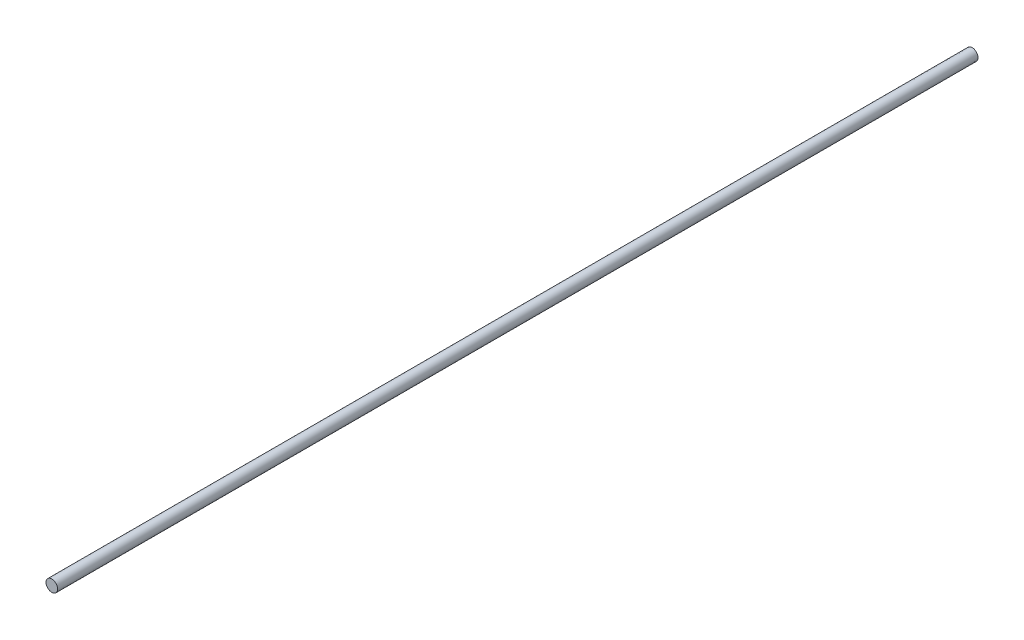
ISO-10303-21;
HEADER;
FILE_DESCRIPTION(('STEP AP214'),'2;1');
FILE_NAME('part.step','',(''),(''),'','','');
FILE_SCHEMA(('AUTOMOTIVE_DESIGN { 1 0 10303 214 1 1 1 1 }'));
ENDSEC;
DATA;
#1=APPLICATION_CONTEXT('core data for automotive mechanical design processes');
#2=APPLICATION_PROTOCOL_DEFINITION('international standard','automotive_design',2000,#1);
#3=PRODUCT_CONTEXT('',#1,'mechanical');
#4=PRODUCT('Part','Part','',(#3));
#5=PRODUCT_RELATED_PRODUCT_CATEGORY('part','',(#4));
#6=PRODUCT_DEFINITION_FORMATION('','',#4);
#7=PRODUCT_DEFINITION_CONTEXT('part definition',#1,'design');
#8=PRODUCT_DEFINITION('design','',#6,#7);
#9=PRODUCT_DEFINITION_SHAPE('','',#8);
#10=(LENGTH_UNIT() NAMED_UNIT(*) SI_UNIT(.MILLI.,.METRE.));
#11=(NAMED_UNIT(*) PLANE_ANGLE_UNIT() SI_UNIT($,.RADIAN.));
#12=(NAMED_UNIT(*) SI_UNIT($,.STERADIAN.) SOLID_ANGLE_UNIT());
#13=UNCERTAINTY_MEASURE_WITH_UNIT(LENGTH_MEASURE(1.E-05),#10,'distance_accuracy_value','');
#14=(GEOMETRIC_REPRESENTATION_CONTEXT(3) GLOBAL_UNCERTAINTY_ASSIGNED_CONTEXT((#13)) GLOBAL_UNIT_ASSIGNED_CONTEXT((#10,
#11,#12)) REPRESENTATION_CONTEXT('',''));
#15=CARTESIAN_POINT('',(0.,0.,0.));
#16=DIRECTION('',(0.,0.,1.));
#17=DIRECTION('',(1.,0.,0.));
#18=AXIS2_PLACEMENT_3D('',#15,#16,#17);
#19=CARTESIAN_POINT('',(-3.33066907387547E-13,-1.66533453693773E-13,475.));
#20=DIRECTION('',(0.,0.,-1.));
#21=DIRECTION('',(-1.,0.,0.));
#22=AXIS2_PLACEMENT_3D('',#19,#20,#21);
#23=CYLINDRICAL_SURFACE('',#22,6.);
#24=CARTESIAN_POINT('',(-3.33066907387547E-13,-1.66533453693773E-13,475.));
#25=DIRECTION('',(0.,0.,1.));
#26=DIRECTION('',(1.,0.,0.));
#27=AXIS2_PLACEMENT_3D('',#24,#25,#26);
#28=CIRCLE('',#27,6.);
#29=CARTESIAN_POINT('',(-6.00000000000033,-1.66533453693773E-13,475.));
#30=VERTEX_POINT('',#29);
#31=EDGE_CURVE('E10',#30,#30,#28,.T.);
#32=CARTESIAN_POINT('',(0.,0.,-474.999999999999));
#33=DIRECTION('',(0.,0.,1.));
#34=DIRECTION('',(1.,0.,0.));
#35=AXIS2_PLACEMENT_3D('',#32,#33,#34);
#36=CIRCLE('',#35,6.);
#37=CARTESIAN_POINT('',(-6.00000000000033,-1.6653345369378E-13,-474.999999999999));
#38=VERTEX_POINT('',#37);
#39=EDGE_CURVE('E43',#38,#38,#36,.T.);
#40=CARTESIAN_POINT('',(-6.00000000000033,-1.66533453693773E-13,475.));
#41=CARTESIAN_POINT('',(-6.00000000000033,-1.66533453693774E-13,465.104166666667));
#42=CARTESIAN_POINT('',(-6.00000000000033,-1.66533453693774E-13,455.208333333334));
#43=CARTESIAN_POINT('',(-6.00000000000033,-1.66533453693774E-13,435.416666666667));
#44=CARTESIAN_POINT('',(-6.00000000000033,-1.66533453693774E-13,425.520833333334));
#45=CARTESIAN_POINT('',(-6.00000000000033,-1.66533453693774E-13,405.729166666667));
#46=CARTESIAN_POINT('',(-6.00000000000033,-1.66533453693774E-13,395.833333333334));
#47=CARTESIAN_POINT('',(-6.00000000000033,-1.66533453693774E-13,376.041666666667));
#48=CARTESIAN_POINT('',(-6.00000000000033,-1.66533453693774E-13,366.145833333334));
#49=CARTESIAN_POINT('',(-6.00000000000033,-1.66533453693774E-13,346.354166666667));
#50=CARTESIAN_POINT('',(-6.00000000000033,-1.66533453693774E-13,336.458333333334));
#51=CARTESIAN_POINT('',(-6.00000000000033,-1.66533453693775E-13,316.666666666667));
#52=CARTESIAN_POINT('',(-6.00000000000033,-1.66533453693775E-13,306.770833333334));
#53=CARTESIAN_POINT('',(-6.00000000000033,-1.66533453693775E-13,286.979166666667));
#54=CARTESIAN_POINT('',(-6.00000000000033,-1.66533453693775E-13,277.083333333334));
#55=CARTESIAN_POINT('',(-6.00000000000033,-1.66533453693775E-13,257.291666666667));
#56=CARTESIAN_POINT('',(-6.00000000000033,-1.66533453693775E-13,247.395833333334));
#57=CARTESIAN_POINT('',(-6.00000000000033,-1.66533453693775E-13,227.604166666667));
#58=CARTESIAN_POINT('',(-6.00000000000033,-1.66533453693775E-13,217.708333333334));
#59=CARTESIAN_POINT('',(-6.00000000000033,-1.66533453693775E-13,197.916666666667));
#60=CARTESIAN_POINT('',(-6.00000000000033,-1.66533453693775E-13,188.020833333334));
#61=CARTESIAN_POINT('',(-6.00000000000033,-1.66533453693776E-13,168.229166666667));
#62=CARTESIAN_POINT('',(-6.00000000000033,-1.66533453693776E-13,158.333333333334));
#63=CARTESIAN_POINT('',(-6.00000000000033,-1.66533453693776E-13,138.541666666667));
#64=CARTESIAN_POINT('',(-6.00000000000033,-1.66533453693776E-13,128.645833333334));
#65=CARTESIAN_POINT('',(-6.00000000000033,-1.66533453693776E-13,108.854166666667));
#66=CARTESIAN_POINT('',(-6.00000000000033,-1.66533453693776E-13,98.9583333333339));
#67=CARTESIAN_POINT('',(-6.00000000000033,-1.66533453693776E-13,79.1666666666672));
#68=CARTESIAN_POINT('',(-6.00000000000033,-1.66533453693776E-13,69.2708333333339));
#69=CARTESIAN_POINT('',(-6.00000000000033,-1.66533453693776E-13,49.4791666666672));
#70=CARTESIAN_POINT('',(-6.00000000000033,-1.66533453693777E-13,39.5833333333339));
#71=CARTESIAN_POINT('',(-6.00000000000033,-1.66533453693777E-13,19.7916666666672));
#72=CARTESIAN_POINT('',(-6.00000000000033,-1.66533453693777E-13,9.89583333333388));
#73=CARTESIAN_POINT('',(-6.00000000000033,-1.66533453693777E-13,-9.89583333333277));
#74=CARTESIAN_POINT('',(-6.00000000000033,-1.66533453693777E-13,-19.7916666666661));
#75=CARTESIAN_POINT('',(-6.00000000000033,-1.66533453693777E-13,-39.5833333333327));
#76=CARTESIAN_POINT('',(-6.00000000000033,-1.66533453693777E-13,-49.4791666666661));
#77=CARTESIAN_POINT('',(-6.00000000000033,-1.66533453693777E-13,-69.2708333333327));
#78=CARTESIAN_POINT('',(-6.00000000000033,-1.66533453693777E-13,-79.166666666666));
#79=CARTESIAN_POINT('',(-6.00000000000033,-1.66533453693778E-13,-98.9583333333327));
#80=CARTESIAN_POINT('',(-6.00000000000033,-1.66533453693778E-13,-108.854166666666));
#81=CARTESIAN_POINT('',(-6.00000000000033,-1.66533453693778E-13,-128.645833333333));
#82=CARTESIAN_POINT('',(-6.00000000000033,-1.66533453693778E-13,-138.541666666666));
#83=CARTESIAN_POINT('',(-6.00000000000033,-1.66533453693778E-13,-158.333333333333));
#84=CARTESIAN_POINT('',(-6.00000000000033,-1.66533453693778E-13,-168.229166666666));
#85=CARTESIAN_POINT('',(-6.00000000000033,-1.66533453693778E-13,-188.020833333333));
#86=CARTESIAN_POINT('',(-6.00000000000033,-1.66533453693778E-13,-197.916666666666));
#87=CARTESIAN_POINT('',(-6.00000000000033,-1.66533453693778E-13,-217.708333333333));
#88=CARTESIAN_POINT('',(-6.00000000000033,-1.66533453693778E-13,-227.604166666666));
#89=CARTESIAN_POINT('',(-6.00000000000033,-1.66533453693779E-13,-247.395833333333));
#90=CARTESIAN_POINT('',(-6.00000000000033,-1.66533453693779E-13,-257.291666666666));
#91=CARTESIAN_POINT('',(-6.00000000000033,-1.66533453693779E-13,-277.083333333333));
#92=CARTESIAN_POINT('',(-6.00000000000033,-1.66533453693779E-13,-286.979166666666));
#93=CARTESIAN_POINT('',(-6.00000000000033,-1.66533453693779E-13,-306.770833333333));
#94=CARTESIAN_POINT('',(-6.00000000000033,-1.66533453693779E-13,-316.666666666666));
#95=CARTESIAN_POINT('',(-6.00000000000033,-1.66533453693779E-13,-336.458333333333));
#96=CARTESIAN_POINT('',(-6.00000000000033,-1.66533453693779E-13,-346.354166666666));
#97=CARTESIAN_POINT('',(-6.00000000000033,-1.66533453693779E-13,-366.145833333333));
#98=CARTESIAN_POINT('',(-6.00000000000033,-1.66533453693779E-13,-376.041666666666));
#99=CARTESIAN_POINT('',(-6.00000000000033,-1.6653345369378E-13,-395.833333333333));
#100=CARTESIAN_POINT('',(-6.00000000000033,-1.6653345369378E-13,-405.729166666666));
#101=CARTESIAN_POINT('',(-6.00000000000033,-1.6653345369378E-13,-425.520833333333));
#102=CARTESIAN_POINT('',(-6.00000000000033,-1.6653345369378E-13,-435.416666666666));
#103=CARTESIAN_POINT('',(-6.00000000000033,-1.6653345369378E-13,-455.208333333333));
#104=CARTESIAN_POINT('',(-6.00000000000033,-1.6653345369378E-13,-465.104166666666));
#105=CARTESIAN_POINT('',(-6.00000000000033,-1.6653345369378E-13,-474.999999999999));
#106=B_SPLINE_CURVE_WITH_KNOTS('',3,(#40,#41,#42,#43,#44,#45,#46,#47,#48,#49,#50,#51,#52,#53,
#54,#55,#56,#57,#58,#59,#60,#61,#62,#63,#64,#65,#66,#67,#68,#69,#70,#71,#72,#73,#74,#75,#76,#77,
#78,#79,#80,#81,#82,#83,#84,#85,#86,#87,#88,#89,#90,#91,#92,#93,#94,#95,#96,#97,#98,#99,#100,
#101,#102,#103,#104,#105),.UNSPECIFIED.,.F.,.F.,(4,2,2,2,2,2,2,2,2,2,2,2,2,2,2,2,2,2,2,2,2,2,2,
2,2,2,2,2,2,2,2,2,4),(0.,29.6875,59.375,89.0625,118.75,148.4375,178.125,207.8125,237.5,267.1875,
296.875,326.5625,356.25,385.9375,415.625,445.3125,475.,504.6875,534.375,564.0625,593.75,
623.4375,653.125,682.8125,712.5,742.1875,771.875,801.5625,831.25,860.9375,890.625,920.3125,
950.),.UNSPECIFIED.);
#107=EDGE_CURVE('BSEAM36',#30,#38,#106,.T.);
#108=ORIENTED_EDGE('',*,*,#31,.F.);
#109=ORIENTED_EDGE('',*,*,#39,.T.);
#110=ORIENTED_EDGE('',*,*,#107,.T.);
#111=ORIENTED_EDGE('',*,*,#107,.F.);
#112=EDGE_LOOP('',(#108,#110,#109,#111));
#113=FACE_BOUND('',#112,.T.);
#114=ADVANCED_FACE('F36',(#113),#23,.T.);
#115=CARTESIAN_POINT('',(-3.33066907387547E-13,-1.66533453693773E-13,475.));
#116=DIRECTION('',(0.,0.,1.));
#117=DIRECTION('',(1.,0.,0.));
#118=AXIS2_PLACEMENT_3D('',#115,#116,#117);
#119=PLANE('',#118);
#120=ORIENTED_EDGE('',*,*,#31,.T.);
#121=EDGE_LOOP('',(#120));
#122=FACE_BOUND('',#121,.T.);
#123=ADVANCED_FACE('F53',(#122),#119,.T.);
#124=CARTESIAN_POINT('',(0.,0.,-474.999999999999));
#125=DIRECTION('',(0.,0.,1.));
#126=DIRECTION('',(1.,0.,0.));
#127=AXIS2_PLACEMENT_3D('',#124,#125,#126);
#128=PLANE('',#127);
#129=ORIENTED_EDGE('',*,*,#39,.F.);
#130=EDGE_LOOP('',(#129));
#131=FACE_BOUND('',#130,.T.);
#132=ADVANCED_FACE('F51',(#131),#128,.F.);
#133=CLOSED_SHELL('',(#114,#123,#132));
#134=MANIFOLD_SOLID_BREP('B2',#133);
#135=ADVANCED_BREP_SHAPE_REPRESENTATION('',(#18,#134),#14);
#136=SHAPE_DEFINITION_REPRESENTATION(#9,#135);
ENDSEC;
END-ISO-10303-21;
